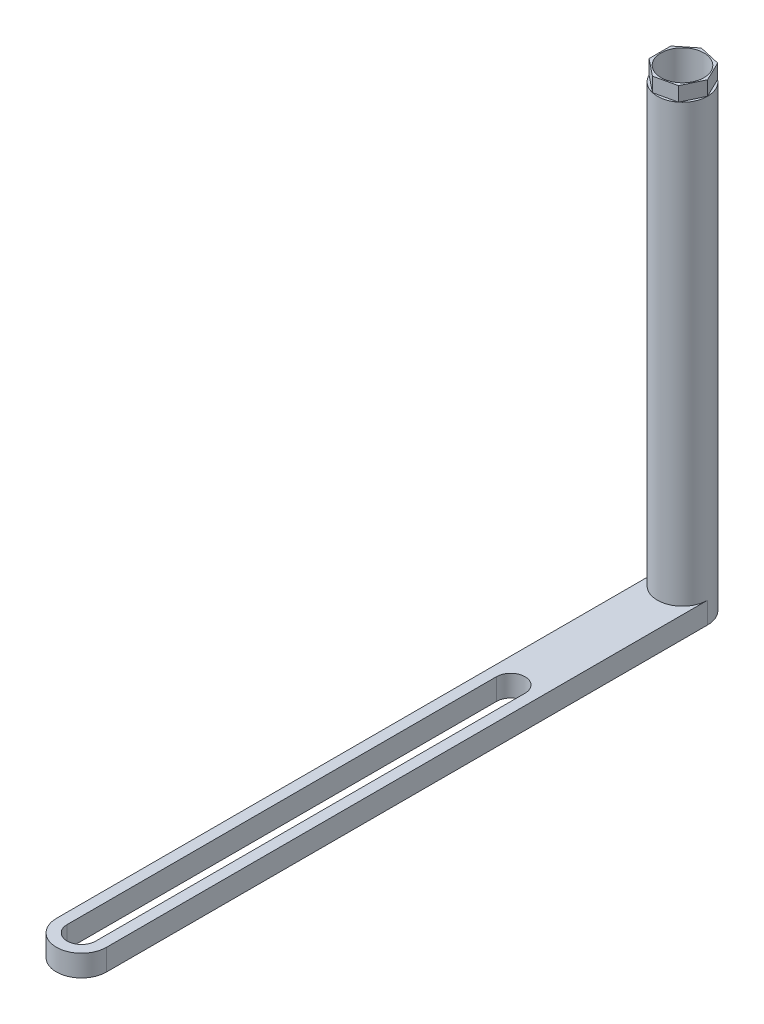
from build123d import *

# Parameters (mm, degrees)
SKETCH1_R           = 1.75
SKETCH1_R_2         = 1.5
BOSS_EXTRUDE1_DEPTH = 33
SKETCH2_R           = 1.5
BOSS_EXTRUDE2_DEPTH = 1.5
CUT_EXTRUDE1_START  = -1
CUT_EXTRUDE1_DEPTH  = 1


with BuildPart() as part:
    # Sketch1 → Boss-Extrude1 (new body)
    with BuildSketch(Plane(origin=(0, 0, 0), x_dir=(1, 0, 0), z_dir=(0, 1, 0))):
        with Locations(Location((0, 0, 0), (0, 0, 270))):
            Circle(SKETCH1_R)
        with Locations(Location((0, 0, 0), (0, 0, 270))):
            Circle(SKETCH1_R_2, mode=Mode.SUBTRACT)
    extrude(amount=BOSS_EXTRUDE1_DEPTH)

    # Sketch2 → Boss-Extrude2 (add)
    with BuildSketch(Plane.XZ):
        with BuildLine():
            Line((-1.75, 0), (-1.75, 42))
            ThreePointArc((-1.75, 42), (0, 43.75), (1.75, 42))
            Line((1.75, 42), (1.75, 0))
            ThreePointArc((1.75, 0), (0, -1.75), (-1.75, 0))
        make_face()
        with Locations(Location((0, 0, 0), (0, 0, 90))):
            Circle(SKETCH2_R, mode=Mode.SUBTRACT)
        with BuildLine():
            Line((1, 42), (1, 12))
            ThreePointArc((1, 12), (0, 11), (-1, 12))
            Line((-1, 12), (-1, 42))
            ThreePointArc((-1, 42), (0, 43), (1, 42))
        make_face(mode=Mode.SUBTRACT)
    extrude(amount=-BOSS_EXTRUDE2_DEPTH)

    # Sketch3 → Cut-Extrude1 (cut)
    with BuildSketch(Plane(origin=(0, 33, 0), x_dir=(1, 0, 0), z_dir=(0, 1, 0)).offset(CUT_EXTRUDE1_START)):
        with BuildLine():
            Line((-1.576695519, 0.759296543), (-0.389411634, 1.706123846))
            ThreePointArc((-0.389411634, 1.706123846), (-1.091107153, 1.368205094), (-1.576695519, 0.759296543))
        make_face()
        with BuildLine():
            Line((-0.389411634, 1.706123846), (1.091107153, 1.368205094))
            ThreePointArc((1.091107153, 1.368205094), (0.389411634, 1.706123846), (-0.389411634, 1.706123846))
        make_face()
        with BuildLine():
            Line((1.091107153, 1.368205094), (1.75, 0))
            ThreePointArc((1.75, 0), (1.576695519, 0.759296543), (1.091107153, 1.368205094))
        make_face()
        with BuildLine():
            ThreePointArc((1.091107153, -1.368205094), (1.576695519, -0.759296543), (1.75, 0))
            Line((1.75, 0), (1.091107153, -1.368205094))
        make_face()
        with BuildLine():
            ThreePointArc((-0.389411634, -1.706123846), (0.389411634, -1.706123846), (1.091107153, -1.368205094))
            Line((1.091107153, -1.368205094), (-0.389411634, -1.706123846))
        make_face()
        with BuildLine():
            ThreePointArc((-1.576695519, -0.759296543), (-1.091107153, -1.368205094), (-0.389411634, -1.706123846))
            Line((-0.389411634, -1.706123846), (-1.576695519, -0.759296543))
        make_face()
        with BuildLine():
            Line((-1.576695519, -0.759296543), (-1.576695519, 0.759296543))
            ThreePointArc((-1.576695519, 0.759296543), (-1.75, 0), (-1.576695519, -0.759296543))
        make_face()
    extrude(amount=CUT_EXTRUDE1_DEPTH, mode=Mode.SUBTRACT)


solid = part.part
